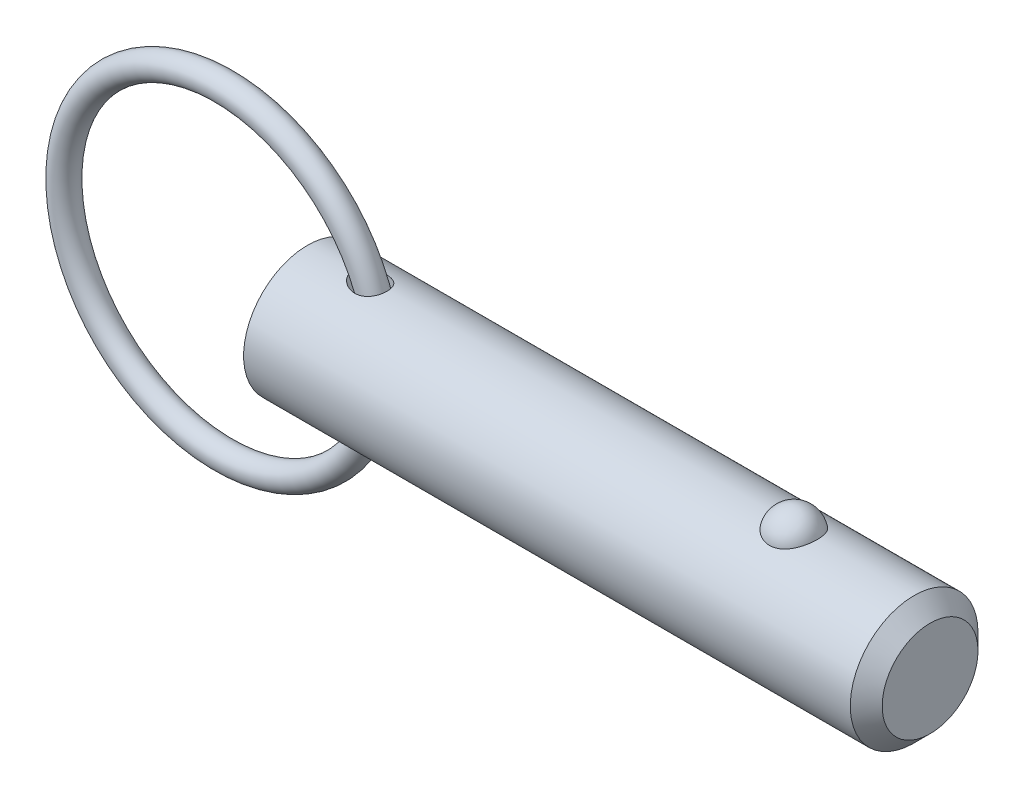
ISO-10303-21;
HEADER;
FILE_DESCRIPTION(('STEP AP214'),'2;1');
FILE_NAME('part.step','',(''),(''),'','','');
FILE_SCHEMA(('AUTOMOTIVE_DESIGN { 1 0 10303 214 1 1 1 1 }'));
ENDSEC;
DATA;
#1=APPLICATION_CONTEXT('core data for automotive mechanical design processes');
#2=APPLICATION_PROTOCOL_DEFINITION('international standard','automotive_design',2000,#1);
#3=PRODUCT_CONTEXT('',#1,'mechanical');
#4=PRODUCT('Part','Part','',(#3));
#5=PRODUCT_RELATED_PRODUCT_CATEGORY('part','',(#4));
#6=PRODUCT_DEFINITION_FORMATION('','',#4);
#7=PRODUCT_DEFINITION_CONTEXT('part definition',#1,'design');
#8=PRODUCT_DEFINITION('design','',#6,#7);
#9=PRODUCT_DEFINITION_SHAPE('','',#8);
#10=(LENGTH_UNIT() NAMED_UNIT(*) SI_UNIT(.MILLI.,.METRE.));
#11=(NAMED_UNIT(*) PLANE_ANGLE_UNIT() SI_UNIT($,.RADIAN.));
#12=(NAMED_UNIT(*) SI_UNIT($,.STERADIAN.) SOLID_ANGLE_UNIT());
#13=UNCERTAINTY_MEASURE_WITH_UNIT(LENGTH_MEASURE(1.E-05),#10,'distance_accuracy_value','');
#14=(GEOMETRIC_REPRESENTATION_CONTEXT(3) GLOBAL_UNCERTAINTY_ASSIGNED_CONTEXT((#13)) GLOBAL_UNIT_ASSIGNED_CONTEXT((#10,
#11,#12)) REPRESENTATION_CONTEXT('',''));
#15=CARTESIAN_POINT('',(0.,0.,0.));
#16=DIRECTION('',(0.,0.,1.));
#17=DIRECTION('',(1.,0.,0.));
#18=AXIS2_PLACEMENT_3D('',#15,#16,#17);
#19=CARTESIAN_POINT('',(-8.34703434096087,0.,0.));
#20=DIRECTION('',(0.,0.,1.));
#21=DIRECTION('',(1.,0.,0.));
#22=AXIS2_PLACEMENT_3D('',#19,#20,#21);
#23=TOROIDAL_SURFACE('',#22,15.875,1.27);
#24=CARTESIAN_POINT('',(8.79796565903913,0.,0.));
#25=VERTEX_POINT('',#24);
#26=VERTEX_LOOP('',#25);
#27=FACE_BOUND('',#26,.T.);
#28=ADVANCED_FACE('P0_F12',(#27),#23,.T.);
#29=CLOSED_SHELL('',(#28));
#30=MANIFOLD_SOLID_BREP('P0_B1',#29);
#31=CARTESIAN_POINT('',(0.,0.,0.));
#32=DIRECTION('',(1.,0.,0.));
#33=DIRECTION('',(0.,0.,-1.));
#34=AXIS2_PLACEMENT_3D('',#31,#32,#33);
#35=CYLINDRICAL_SURFACE('',#34,6.35);
#36=CARTESIAN_POINT('',(4.87230670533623,6.27273159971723,-0.987592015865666));
#37=CARTESIAN_POINT('',(4.94734735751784,6.26035058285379,-1.06623378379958));
#38=CARTESIAN_POINT('',(5.02968768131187,6.24755813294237,-1.13788608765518));
#39=CARTESIAN_POINT('',(5.20534267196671,6.22278258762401,-1.26640223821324));
#40=CARTESIAN_POINT('',(5.29867273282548,6.21080066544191,-1.32324497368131));
#41=CARTESIAN_POINT('',(5.49318962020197,6.18912414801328,-1.42117930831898));
#42=CARTESIAN_POINT('',(5.59435470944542,6.17942350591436,-1.46231273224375));
#43=CARTESIAN_POINT('',(5.802196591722,6.16352555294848,-1.52793951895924));
#44=CARTESIAN_POINT('',(5.90887152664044,6.15732706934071,-1.55243845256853));
#45=CARTESIAN_POINT('',(6.12818220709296,6.14931784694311,-1.58387975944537));
#46=CARTESIAN_POINT('',(6.24090110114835,6.14763959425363,-1.59029227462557));
#47=CARTESIAN_POINT('',(6.46560233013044,6.14965588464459,-1.58248630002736));
#48=CARTESIAN_POINT('',(6.57758514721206,6.15334646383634,-1.56828303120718));
#49=CARTESIAN_POINT('',(6.78516594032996,6.1652116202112,-1.52091398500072));
#50=CARTESIAN_POINT('',(6.88126802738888,6.17288876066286,-1.48983713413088));
#51=CARTESIAN_POINT('',(7.06576629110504,6.19149190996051,-1.41052329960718));
#52=CARTESIAN_POINT('',(7.15416739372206,6.20241582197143,-1.36229738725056));
#53=CARTESIAN_POINT('',(7.31166929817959,6.2248616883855,-1.25548983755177));
#54=CARTESIAN_POINT('',(7.38181442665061,6.23621734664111,-1.19840625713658));
#55=CARTESIAN_POINT('',(7.51101296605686,6.259037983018,-1.07284763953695));
#56=CARTESIAN_POINT('',(7.57006844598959,6.2705029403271,-1.00437473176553));
#57=CARTESIAN_POINT('',(7.67374693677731,6.29184873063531,-0.860384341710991));
#58=CARTESIAN_POINT('',(7.71876694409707,6.30176816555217,-0.785157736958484));
#59=CARTESIAN_POINT('',(7.79574491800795,6.31935829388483,-0.628053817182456));
#60=CARTESIAN_POINT('',(7.82770308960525,6.32702902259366,-0.546176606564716));
#61=CARTESIAN_POINT('',(7.87788845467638,6.33930929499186,-0.377876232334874));
#62=CARTESIAN_POINT('',(7.89608106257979,6.34391112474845,-0.291442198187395));
#63=CARTESIAN_POINT('',(7.91820729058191,6.34953044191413,-0.116652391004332));
#64=CARTESIAN_POINT('',(7.92214044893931,6.35054781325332,-0.0282965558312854));
#65=CARTESIAN_POINT('',(7.91564686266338,6.34888556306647,0.148263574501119));
#66=CARTESIAN_POINT('',(7.90515337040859,6.34618875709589,0.236465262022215));
#67=CARTESIAN_POINT('',(7.86991530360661,6.33735741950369,0.409798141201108));
#68=CARTESIAN_POINT('',(7.84517062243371,6.33122286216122,0.494929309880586));
#69=CARTESIAN_POINT('',(7.78199851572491,6.31618517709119,0.659657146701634));
#70=CARTESIAN_POINT('',(7.74357645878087,6.30728313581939,0.739255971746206));
#71=CARTESIAN_POINT('',(7.65396632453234,6.28769050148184,0.890663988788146));
#72=CARTESIAN_POINT('',(7.60277911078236,6.27700002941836,0.962473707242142));
#73=CARTESIAN_POINT('',(7.48925881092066,6.2550822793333,1.09590260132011));
#74=CARTESIAN_POINT('',(7.42698604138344,6.24385813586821,1.15757361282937));
#75=CARTESIAN_POINT('',(7.29283556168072,6.2220655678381,1.26951234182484));
#76=CARTESIAN_POINT('',(7.2209588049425,6.21149707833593,1.31978118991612));
#77=CARTESIAN_POINT('',(7.06971853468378,6.19216002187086,1.40772509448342));
#78=CARTESIAN_POINT('',(6.99035873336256,6.18339056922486,1.44540635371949));
#79=CARTESIAN_POINT('',(6.82642723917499,6.16851603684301,1.50762653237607));
#80=CARTESIAN_POINT('',(6.74185489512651,6.16241129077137,1.53216380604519));
#81=CARTESIAN_POINT('',(6.56686412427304,6.15321474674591,1.56869994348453));
#82=CARTESIAN_POINT('',(6.47634467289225,6.15023369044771,1.58023897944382));
#83=CARTESIAN_POINT('',(6.29456956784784,6.14778331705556,1.58974172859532));
#84=CARTESIAN_POINT('',(6.20331368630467,6.1483151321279,1.58770106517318));
#85=CARTESIAN_POINT('',(6.01385969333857,6.15284811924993,1.5700487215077));
#86=CARTESIAN_POINT('',(5.91578322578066,6.15715979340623,1.55322212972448));
#87=CARTESIAN_POINT('',(5.72331909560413,6.16902415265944,1.5054032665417));
#88=CARTESIAN_POINT('',(5.62893440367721,6.17657939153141,1.4743998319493));
#89=CARTESIAN_POINT('',(5.43572606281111,6.19502494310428,1.39499475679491));
#90=CARTESIAN_POINT('',(5.33755891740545,6.20619097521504,1.3450526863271));
#91=CARTESIAN_POINT('',(5.15090047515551,6.23006191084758,1.22975103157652));
#92=CARTESIAN_POINT('',(5.06240741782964,6.24276653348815,1.16439425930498));
#93=CARTESIAN_POINT('',(4.91171642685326,6.26607433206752,1.03083814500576));
#94=CARTESIAN_POINT('',(4.8475822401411,6.27668356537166,0.964825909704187));
#95=CARTESIAN_POINT('',(4.73090054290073,6.29683133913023,0.823112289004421));
#96=CARTESIAN_POINT('',(4.67833688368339,6.30637136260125,0.747424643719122));
#97=CARTESIAN_POINT('',(4.595431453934,6.32183254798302,0.601150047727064));
#98=CARTESIAN_POINT('',(4.56283099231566,6.32809321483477,0.531883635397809));
#99=CARTESIAN_POINT('',(4.50941370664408,6.33849198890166,0.388778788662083));
#100=CARTESIAN_POINT('',(4.48858876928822,6.34263155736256,0.314943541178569));
#101=CARTESIAN_POINT('',(4.46008864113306,6.3483236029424,0.164282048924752));
#102=CARTESIAN_POINT('',(4.45247558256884,6.34986385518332,0.0874434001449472));
#103=CARTESIAN_POINT('',(4.45121096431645,6.35011863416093,-0.0663538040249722));
#104=CARTESIAN_POINT('',(4.45755802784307,6.34883343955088,-0.143312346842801));
#105=CARTESIAN_POINT('',(4.48267656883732,6.34380948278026,-0.288945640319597));
#106=CARTESIAN_POINT('',(4.50045680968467,6.34026665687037,-0.357802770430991));
#107=CARTESIAN_POINT('',(4.54636050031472,6.33128211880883,-0.49181574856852));
#108=CARTESIAN_POINT('',(4.57448566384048,6.32584009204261,-0.556970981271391));
#109=CARTESIAN_POINT('',(4.64209700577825,6.31308107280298,-0.687092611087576));
#110=CARTESIAN_POINT('',(4.6822690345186,6.30565525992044,-0.75168940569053));
#111=CARTESIAN_POINT('',(4.77120834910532,6.28979741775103,-0.874524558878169));
#112=CARTESIAN_POINT('',(4.81998302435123,6.28136452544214,-0.932757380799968));
#113=CARTESIAN_POINT('',(4.87230670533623,6.27273159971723,-0.987592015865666));
#114=B_SPLINE_CURVE_WITH_KNOTS('',3,(#36,#37,#38,#39,#40,#41,#42,#43,#44,#45,#46,#47,#48,#49,
#50,#51,#52,#53,#54,#55,#56,#57,#58,#59,#60,#61,#62,#63,#64,#65,#66,#67,#68,#69,#70,#71,#72,#73,
#74,#75,#76,#77,#78,#79,#80,#81,#82,#83,#84,#85,#86,#87,#88,#89,#90,#91,#92,#93,#94,#95,#96,#97,
#98,#99,#100,#101,#102,#103,#104,#105,#106,#107,#108,#109,#110,#111,#112,#113),.UNSPECIFIED.,
.T.,.F.,(4,2,2,2,2,2,2,2,2,2,2,2,2,2,2,2,2,2,2,2,2,2,2,2,2,2,2,2,2,2,2,2,2,2,2,2,2,2,4),(0.,
0.327902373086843,0.65626964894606,0.98375647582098,1.31113357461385,1.64800657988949,
1.98463099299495,2.28681225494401,2.58879878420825,2.86088594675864,3.13292229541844,
3.39636481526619,3.65980320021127,3.92390128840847,4.18800792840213,4.45334062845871,
4.7186753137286,4.98390596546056,5.24911867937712,5.51293017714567,5.7767155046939,
6.04037065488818,6.30405880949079,6.57680801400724,6.84964512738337,7.14724526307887,
7.44508014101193,7.77572668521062,8.10631295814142,8.38318772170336,8.65967357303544,
8.8891530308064,9.11847418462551,9.34887088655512,9.57924486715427,9.79193291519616,
10.0046562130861,10.2330958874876,10.4617327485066),.UNSPECIFIED.);
#115=CARTESIAN_POINT('',(4.87230670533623,6.27273159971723,-0.987592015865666));
#116=VERTEX_POINT('',#115);
#117=EDGE_CURVE('P1_E40',#116,#116,#114,.T.);
#118=ORIENTED_EDGE('',*,*,#117,.T.);
#119=EDGE_LOOP('',(#118));
#120=FACE_BOUND('',#119,.T.);
#121=CARTESIAN_POINT('',(60.3125,0.,0.));
#122=DIRECTION('',(1.,0.,0.));
#123=DIRECTION('',(0.,0.,-1.));
#124=AXIS2_PLACEMENT_3D('',#121,#122,#123);
#125=CIRCLE('',#124,6.35);
#126=CARTESIAN_POINT('',(60.3125,0.,-6.35));
#127=VERTEX_POINT('',#126);
#128=EDGE_CURVE('P1_E25',#127,#127,#125,.T.);
#129=ORIENTED_EDGE('',*,*,#128,.F.);
#130=EDGE_LOOP('',(#129));
#131=FACE_BOUND('',#130,.T.);
#132=CARTESIAN_POINT('',(0.,0.,0.));
#133=DIRECTION('',(1.,0.,0.));
#134=DIRECTION('',(0.,0.,-1.));
#135=AXIS2_PLACEMENT_3D('',#132,#133,#134);
#136=CIRCLE('',#135,6.35);
#137=CARTESIAN_POINT('',(0.,0.,-6.35));
#138=VERTEX_POINT('',#137);
#139=EDGE_CURVE('P1_E9',#138,#138,#136,.T.);
#140=ORIENTED_EDGE('',*,*,#139,.T.);
#141=EDGE_LOOP('',(#140));
#142=FACE_BOUND('',#141,.T.);
#143=CARTESIAN_POINT('',(48.3500214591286,5.87502187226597,2.40969251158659));
#144=CARTESIAN_POINT('',(48.2250305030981,5.87501645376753,2.40969773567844));
#145=CARTESIAN_POINT('',(48.1000806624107,5.87916061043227,2.39967292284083));
#146=CARTESIAN_POINT('',(47.8539091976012,5.8952311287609,2.3599173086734));
#147=CARTESIAN_POINT('',(47.7326863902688,5.90715499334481,2.33019283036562));
#148=CARTESIAN_POINT('',(47.4975170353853,5.93739567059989,2.25201402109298));
#149=CARTESIAN_POINT('',(47.3835602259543,5.95570321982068,2.20358681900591));
#150=CARTESIAN_POINT('',(47.16557352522,5.99672067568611,2.08937987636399));
#151=CARTESIAN_POINT('',(47.0615457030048,6.01943149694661,2.02359652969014));
#152=CARTESIAN_POINT('',(46.8629437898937,6.06760647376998,1.87428969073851));
#153=CARTESIAN_POINT('',(46.7687268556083,6.09313095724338,1.79031110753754));
#154=CARTESIAN_POINT('',(46.5952557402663,6.14375873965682,1.60800178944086));
#155=CARTESIAN_POINT('',(46.5160043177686,6.16886196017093,1.50966841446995));
#156=CARTESIAN_POINT('',(46.3708457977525,6.21724600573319,1.29645884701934));
#157=CARTESIAN_POINT('',(46.3056885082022,6.24039621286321,1.18104158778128));
#158=CARTESIAN_POINT('',(46.1947035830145,6.28117277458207,0.940351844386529));
#159=CARTESIAN_POINT('',(46.1488776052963,6.29879865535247,0.815078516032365));
#160=CARTESIAN_POINT('',(46.0770234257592,6.32692073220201,0.556494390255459));
#161=CARTESIAN_POINT('',(46.051249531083,6.33732517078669,0.423102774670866));
#162=CARTESIAN_POINT('',(46.0209885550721,6.34957673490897,0.15354272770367));
#163=CARTESIAN_POINT('',(46.0165009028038,6.35142408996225,0.0173743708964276));
#164=CARTESIAN_POINT('',(46.0288655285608,6.34638925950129,-0.253036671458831));
#165=CARTESIAN_POINT('',(46.0455949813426,6.33955731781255,-0.387285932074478));
#166=CARTESIAN_POINT('',(46.099843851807,6.31794129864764,-0.650851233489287));
#167=CARTESIAN_POINT('',(46.1373636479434,6.30315707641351,-0.780167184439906));
#168=CARTESIAN_POINT('',(46.232500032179,6.26711642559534,-1.03041949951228));
#169=CARTESIAN_POINT('',(46.290143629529,6.24585130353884,-1.15134433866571));
#170=CARTESIAN_POINT('',(46.4243522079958,6.19905619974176,-1.38129800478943));
#171=CARTESIAN_POINT('',(46.5009187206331,6.17352587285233,-1.49032586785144));
#172=CARTESIAN_POINT('',(46.6717538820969,6.12080227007,-1.69393164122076));
#173=CARTESIAN_POINT('',(46.7661008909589,6.09360200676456,-1.78844209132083));
#174=CARTESIAN_POINT('',(46.9701196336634,6.04070434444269,-1.95970536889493));
#175=CARTESIAN_POINT('',(47.0797900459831,6.01500681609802,-2.03645972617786));
#176=CARTESIAN_POINT('',(47.3091876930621,5.96867714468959,-2.1684564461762));
#177=CARTESIAN_POINT('',(47.4286522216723,5.94794910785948,-2.2241206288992));
#178=CARTESIAN_POINT('',(47.6762188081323,5.91340580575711,-2.31440992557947));
#179=CARTESIAN_POINT('',(47.8043175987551,5.89958794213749,-2.3490429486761));
#180=CARTESIAN_POINT('',(48.058582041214,5.88111049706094,-2.39491590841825));
#181=CARTESIAN_POINT('',(48.1845207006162,5.87602512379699,-2.40724512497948));
#182=CARTESIAN_POINT('',(48.4367867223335,5.87428980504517,-2.41147867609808));
#183=CARTESIAN_POINT('',(48.563114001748,5.87763817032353,-2.40338710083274));
#184=CARTESIAN_POINT('',(48.8084170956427,5.89212921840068,-2.36762715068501));
#185=CARTESIAN_POINT('',(48.9274992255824,5.90302431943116,-2.34058030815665));
#186=CARTESIAN_POINT('',(49.1592447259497,5.93113752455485,-2.26839066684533));
#187=CARTESIAN_POINT('',(49.2719075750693,5.94835614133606,-2.22324640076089));
#188=CARTESIAN_POINT('',(49.4904009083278,5.98773016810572,-2.11493806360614));
#189=CARTESIAN_POINT('',(49.596028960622,6.00998499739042,-2.05140269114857));
#190=CARTESIAN_POINT('',(49.7953006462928,6.05690144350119,-1.90842705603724));
#191=CARTESIAN_POINT('',(49.8889415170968,6.08156361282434,-1.82898313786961));
#192=CARTESIAN_POINT('',(50.0666754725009,6.13211715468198,-1.65182429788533));
#193=CARTESIAN_POINT('',(50.150055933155,6.15800825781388,-1.55339381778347));
#194=CARTESIAN_POINT('',(50.2997900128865,6.20712834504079,-1.34374214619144));
#195=CARTESIAN_POINT('',(50.3661405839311,6.23035685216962,-1.23251867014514));
#196=CARTESIAN_POINT('',(50.4823455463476,6.27251177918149,-0.996447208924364));
#197=CARTESIAN_POINT('',(50.5316072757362,6.29127762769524,-0.871278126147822));
#198=CARTESIAN_POINT('',(50.6096142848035,6.3215862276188,-0.613870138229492));
#199=CARTESIAN_POINT('',(50.6383593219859,6.33312889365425,-0.481631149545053));
#200=CARTESIAN_POINT('',(50.6747705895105,6.34782349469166,-0.213672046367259));
#201=CARTESIAN_POINT('',(50.6824134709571,6.35096613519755,-0.0779482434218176));
#202=CARTESIAN_POINT('',(50.6763951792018,6.34851322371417,0.192943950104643));
#203=CARTESIAN_POINT('',(50.6627343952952,6.3429178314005,0.328112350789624));
#204=CARTESIAN_POINT('',(50.6145036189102,6.32360512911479,0.593406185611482));
#205=CARTESIAN_POINT('',(50.5800313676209,6.30992579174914,0.723552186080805));
#206=CARTESIAN_POINT('',(50.4909539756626,6.27586325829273,0.97583417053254));
#207=CARTESIAN_POINT('',(50.4363476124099,6.25547965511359,1.09796966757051));
#208=CARTESIAN_POINT('',(50.3077587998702,6.20998183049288,1.33148921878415));
#209=CARTESIAN_POINT('',(50.2336742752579,6.18484288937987,1.44281227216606));
#210=CARTESIAN_POINT('',(50.0678204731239,6.13258735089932,1.65087683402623));
#211=CARTESIAN_POINT('',(49.9760515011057,6.10547078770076,1.74761859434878));
#212=CARTESIAN_POINT('',(49.7771839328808,6.05235879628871,1.92350926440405));
#213=CARTESIAN_POINT('',(49.670133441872,6.0263601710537,2.00271146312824));
#214=CARTESIAN_POINT('',(49.4431384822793,5.97843747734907,2.14154159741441));
#215=CARTESIAN_POINT('',(49.323191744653,5.95651412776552,2.20116608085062));
#216=CARTESIAN_POINT('',(49.0645236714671,5.91812106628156,2.30250570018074));
#217=CARTESIAN_POINT('',(48.9250698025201,5.90217533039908,2.34256795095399));
#218=CARTESIAN_POINT('',(48.6403974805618,5.88063128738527,2.39615214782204));
#219=CARTESIAN_POINT('',(48.4951817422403,5.8750281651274,2.40968644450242));
#220=CARTESIAN_POINT('',(48.3500214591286,5.87502187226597,2.40969251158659));
#221=B_SPLINE_CURVE_WITH_KNOTS('',3,(#143,#144,#145,#146,#147,#148,#149,#150,#151,#152,#153,
#154,#155,#156,#157,#158,#159,#160,#161,#162,#163,#164,#165,#166,#167,#168,#169,#170,#171,#172,
#173,#174,#175,#176,#177,#178,#179,#180,#181,#182,#183,#184,#185,#186,#187,#188,#189,#190,#191,
#192,#193,#194,#195,#196,#197,#198,#199,#200,#201,#202,#203,#204,#205,#206,#207,#208,#209,#210,
#211,#212,#213,#214,#215,#216,#217,#218,#219,#220),.UNSPECIFIED.,.T.,.F.,(4,2,2,2,2,2,2,2,2,2,2,
2,2,2,2,2,2,2,2,2,2,2,2,2,2,2,2,2,2,2,2,2,2,2,2,2,2,2,4),(0.,0.374440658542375,0.74876119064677,
1.12254078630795,1.49639810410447,1.88098871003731,2.26565013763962,2.6674110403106,
3.06920639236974,3.47601794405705,3.88281858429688,4.28727498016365,4.69173873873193,
5.09674745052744,5.50178895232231,5.90865911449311,6.31549420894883,6.71369855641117,
7.11175305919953,7.48978077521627,7.86773278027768,8.2338388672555,8.59997464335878,
8.97409044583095,9.34829231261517,9.74122667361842,10.1342313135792,10.5397522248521,
10.9452779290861,11.3512521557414,11.7572189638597,12.1612938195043,12.5653932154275,
12.9716540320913,13.3779078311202,13.7829098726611,14.1879832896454,14.6230486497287,
15.0579114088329),.UNSPECIFIED.);
#222=CARTESIAN_POINT('',(48.3500214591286,5.87502187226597,2.40969251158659));
#223=VERTEX_POINT('',#222);
#224=EDGE_CURVE('P1_E34',#223,#223,#221,.T.);
#225=ORIENTED_EDGE('',*,*,#224,.T.);
#226=EDGE_LOOP('',(#225));
#227=FACE_BOUND('',#226,.T.);
#228=CARTESIAN_POINT('',(4.87230670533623,-6.27273159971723,-0.987592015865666));
#229=CARTESIAN_POINT('',(4.81440819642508,-6.28228431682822,-0.926913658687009));
#230=CARTESIAN_POINT('',(4.76085022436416,-6.29159289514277,-0.862071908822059));
#231=CARTESIAN_POINT('',(4.66448472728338,-6.3088950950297,-0.724655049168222));
#232=CARTESIAN_POINT('',(4.62166818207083,-6.31688981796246,-0.652086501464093));
#233=CARTESIAN_POINT('',(4.54882773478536,-6.33076917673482,-0.499747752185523));
#234=CARTESIAN_POINT('',(4.51891553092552,-6.33663532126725,-0.419921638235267));
#235=CARTESIAN_POINT('',(4.47476924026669,-6.3453711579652,-0.255882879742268));
#236=CARTESIAN_POINT('',(4.46051880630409,-6.34824397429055,-0.171674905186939));
#237=CARTESIAN_POINT('',(4.44966179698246,-6.35043041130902,-0.012076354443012));
#238=CARTESIAN_POINT('',(4.45117530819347,-6.35012328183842,0.063184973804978));
#239=CARTESIAN_POINT('',(4.46726452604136,-6.34689000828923,0.212230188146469));
#240=CARTESIAN_POINT('',(4.4818402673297,-6.3439638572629,0.286014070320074));
#241=CARTESIAN_POINT('',(4.52202068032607,-6.33603071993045,0.426550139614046));
#242=CARTESIAN_POINT('',(4.54707079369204,-6.33112875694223,0.493469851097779));
#243=CARTESIAN_POINT('',(4.60669855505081,-6.31972370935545,0.622743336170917));
#244=CARTESIAN_POINT('',(4.64127887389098,-6.31322017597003,0.685095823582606));
#245=CARTESIAN_POINT('',(4.72328142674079,-6.29826068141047,0.811769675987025));
#246=CARTESIAN_POINT('',(4.7717611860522,-6.28966287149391,0.87538636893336));
#247=CARTESIAN_POINT('',(4.87703902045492,-6.27182325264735,0.995192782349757));
#248=CARTESIAN_POINT('',(4.93384225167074,-6.26258104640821,1.05137785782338));
#249=CARTESIAN_POINT('',(5.06617436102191,-6.24228878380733,1.16635591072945));
#250=CARTESIAN_POINT('',(5.14318167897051,-6.23124423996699,1.22345054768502));
#251=CARTESIAN_POINT('',(5.30475767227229,-6.21023402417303,1.32598441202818));
#252=CARTESIAN_POINT('',(5.38933237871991,-6.20026922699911,1.37141422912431));
#253=CARTESIAN_POINT('',(5.5776013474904,-6.18099350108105,1.45601817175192));
#254=CARTESIAN_POINT('',(5.68224348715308,-6.17201456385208,1.4931788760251));
#255=CARTESIAN_POINT('',(5.89649087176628,-6.15800474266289,1.5499484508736));
#256=CARTESIAN_POINT('',(6.0060970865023,-6.15297463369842,1.56955387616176));
#257=CARTESIAN_POINT('',(6.22752772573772,-6.14779725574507,1.58971993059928));
#258=CARTESIAN_POINT('',(6.33935715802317,-6.14766266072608,1.59023112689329));
#259=CARTESIAN_POINT('',(6.56108231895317,-6.15269227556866,1.57066564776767));
#260=CARTESIAN_POINT('',(6.67097982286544,-6.15785133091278,1.55060899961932));
#261=CARTESIAN_POINT('',(6.87257705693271,-6.17211580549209,1.4927326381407));
#262=CARTESIAN_POINT('',(6.96494608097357,-6.18072242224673,1.45711948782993));
#263=CARTESIAN_POINT('',(7.14129343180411,-6.20069920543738,1.36960980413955));
#264=CARTESIAN_POINT('',(7.22527609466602,-6.21206793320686,1.31772174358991));
#265=CARTESIAN_POINT('',(7.37471505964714,-6.23497047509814,1.20443359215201));
#266=CARTESIAN_POINT('',(7.44115811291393,-6.24639757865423,1.14430788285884));
#267=CARTESIAN_POINT('',(7.56261868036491,-6.26896339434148,1.0134084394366));
#268=CARTESIAN_POINT('',(7.61763801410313,-6.28010215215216,0.942636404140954));
#269=CARTESIAN_POINT('',(7.71360563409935,-6.30055923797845,0.794304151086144));
#270=CARTESIAN_POINT('',(7.75485562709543,-6.3099143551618,0.716943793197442));
#271=CARTESIAN_POINT('',(7.82406051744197,-6.32610528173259,0.556244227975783));
#272=CARTESIAN_POINT('',(7.85201540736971,-6.33294108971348,0.472905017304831));
#273=CARTESIAN_POINT('',(7.89408663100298,-6.34338077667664,0.302249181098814));
#274=CARTESIAN_POINT('',(7.90814615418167,-6.34697138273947,0.214917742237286));
#275=CARTESIAN_POINT('',(7.92192329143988,-6.35048887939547,0.0390564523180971));
#276=CARTESIAN_POINT('',(7.92164046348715,-6.3504156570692,-0.0494734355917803));
#277=CARTESIAN_POINT('',(7.90670754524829,-6.34660520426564,-0.225592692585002));
#278=CARTESIAN_POINT('',(7.89199989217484,-6.34285329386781,-0.313176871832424));
#279=CARTESIAN_POINT('',(7.8484534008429,-6.33206809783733,-0.484549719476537));
#280=CARTESIAN_POINT('',(7.8196145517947,-6.32503480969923,-0.568338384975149));
#281=CARTESIAN_POINT('',(7.74850591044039,-6.30846389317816,-0.729625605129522));
#282=CARTESIAN_POINT('',(7.70625193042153,-6.29892921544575,-0.807131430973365));
#283=CARTESIAN_POINT('',(7.60933437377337,-6.27840608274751,-0.953731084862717));
#284=CARTESIAN_POINT('',(7.55467181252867,-6.2674177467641,-1.02282560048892));
#285=CARTESIAN_POINT('',(7.43471786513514,-6.24527869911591,-1.15028913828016));
#286=CARTESIAN_POINT('',(7.36948829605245,-6.23412925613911,-1.20871657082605));
#287=CARTESIAN_POINT('',(7.23001723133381,-6.21283678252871,-1.3137894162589));
#288=CARTESIAN_POINT('',(7.15577649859,-6.20269366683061,-1.36043582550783));
#289=CARTESIAN_POINT('',(7.00025986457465,-6.18446636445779,-1.44103993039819));
#290=CARTESIAN_POINT('',(6.91896776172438,-6.17638709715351,-1.47496739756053));
#291=CARTESIAN_POINT('',(6.75184232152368,-6.16309237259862,-1.52957024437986));
#292=CARTESIAN_POINT('',(6.66600814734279,-6.15787744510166,-1.55024317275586));
#293=CARTESIAN_POINT('',(6.48842585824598,-6.15055064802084,-1.57906962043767));
#294=CARTESIAN_POINT('',(6.39658108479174,-6.14857915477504,-1.58665744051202));
#295=CARTESIAN_POINT('',(6.21279832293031,-6.14817707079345,-1.58821048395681));
#296=CARTESIAN_POINT('',(6.12086031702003,-6.14974736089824,-1.58217231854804));
#297=CARTESIAN_POINT('',(5.92996902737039,-6.15640095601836,-1.55609403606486));
#298=CARTESIAN_POINT('',(5.83120653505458,-6.16181208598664,-1.53474519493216));
#299=CARTESIAN_POINT('',(5.63804881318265,-6.17573474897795,-1.47771859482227));
#300=CARTESIAN_POINT('',(5.5436595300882,-6.18425037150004,-1.44202192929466));
#301=CARTESIAN_POINT('',(5.3441392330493,-6.20522938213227,-1.34918979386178));
#302=CARTESIAN_POINT('',(5.24033140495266,-6.21813417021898,-1.28928337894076));
#303=CARTESIAN_POINT('',(5.04554233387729,-6.24510162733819,-1.15156760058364));
#304=CARTESIAN_POINT('',(4.9545459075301,-6.25916289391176,-1.07377972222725));
#305=CARTESIAN_POINT('',(4.87230670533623,-6.27273159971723,-0.987592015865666));
#306=B_SPLINE_CURVE_WITH_KNOTS('',3,(#228,#229,#230,#231,#232,#233,#234,#235,#236,#237,#238,
#239,#240,#241,#242,#243,#244,#245,#246,#247,#248,#249,#250,#251,#252,#253,#254,#255,#256,#257,
#258,#259,#260,#261,#262,#263,#264,#265,#266,#267,#268,#269,#270,#271,#272,#273,#274,#275,#276,
#277,#278,#279,#280,#281,#282,#283,#284,#285,#286,#287,#288,#289,#290,#291,#292,#293,#294,#295,
#296,#297,#298,#299,#300,#301,#302,#303,#304,#305),.UNSPECIFIED.,.T.,.F.,(4,2,2,2,2,2,2,2,2,2,2,
2,2,2,2,2,2,2,2,2,2,2,2,2,2,2,2,2,2,2,2,2,2,2,2,2,2,2,4),(0.,0.252951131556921,0.50568912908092,
0.760572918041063,1.01519041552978,1.23982791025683,1.46446600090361,1.67847364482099,
1.89254132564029,2.13299551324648,2.37359928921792,2.6619896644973,2.95061196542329,
3.28329078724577,3.61603488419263,3.94964035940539,4.282921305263,4.57939201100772,
4.87570862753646,5.14538810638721,5.4150245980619,5.67829123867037,5.94155802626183,
6.20589676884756,6.47024365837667,6.73564974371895,7.00105603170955,7.26615064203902,
7.53122356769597,7.79479837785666,8.05835088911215,8.32252586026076,8.58674967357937,
8.86213419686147,9.137587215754,9.43991696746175,9.74264642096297,10.1023688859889,
10.461661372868),.UNSPECIFIED.);
#307=CARTESIAN_POINT('',(4.87230670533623,-6.27273159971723,-0.987592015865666));
#308=VERTEX_POINT('',#307);
#309=EDGE_CURVE('P1_E17',#308,#308,#306,.T.);
#310=ORIENTED_EDGE('',*,*,#309,.T.);
#311=EDGE_LOOP('',(#310));
#312=FACE_BOUND('',#311,.T.);
#313=ADVANCED_FACE('P1_F13',(#120,#131,#142,#227,#312),#35,.T.);
#314=CARTESIAN_POINT('',(0.,0.,0.));
#315=DIRECTION('',(-1.,0.,0.));
#316=DIRECTION('',(0.,0.,1.));
#317=AXIS2_PLACEMENT_3D('',#314,#315,#316);
#318=PLANE('',#317);
#319=ORIENTED_EDGE('',*,*,#139,.F.);
#320=EDGE_LOOP('',(#319));
#321=FACE_BOUND('',#320,.T.);
#322=ADVANCED_FACE('P1_F15',(#321),#318,.T.);
#323=CARTESIAN_POINT('',(61.9,0.,0.));
#324=DIRECTION('',(-1.,0.,0.));
#325=DIRECTION('',(0.,0.,1.));
#326=AXIS2_PLACEMENT_3D('',#323,#324,#325);
#327=CONICAL_SURFACE('',#326,4.76250000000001,0.785398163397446);
#328=ORIENTED_EDGE('',*,*,#128,.T.);
#329=EDGE_LOOP('',(#328));
#330=FACE_BOUND('',#329,.T.);
#331=CARTESIAN_POINT('',(61.9,0.,0.));
#332=DIRECTION('',(1.,0.,0.));
#333=DIRECTION('',(0.,0.,-1.));
#334=AXIS2_PLACEMENT_3D('',#331,#332,#333);
#335=CIRCLE('',#334,4.76250000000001);
#336=CARTESIAN_POINT('',(61.9,0.,-4.76250000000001));
#337=VERTEX_POINT('',#336);
#338=EDGE_CURVE('P1_E30',#337,#337,#335,.T.);
#339=ORIENTED_EDGE('',*,*,#338,.F.);
#340=EDGE_LOOP('',(#339));
#341=FACE_BOUND('',#340,.T.);
#342=ADVANCED_FACE('P1_F55',(#330,#341),#327,.T.);
#343=CARTESIAN_POINT('',(61.9,4.76250000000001,0.));
#344=DIRECTION('',(1.,0.,0.));
#345=DIRECTION('',(0.,0.,-1.));
#346=AXIS2_PLACEMENT_3D('',#343,#344,#345);
#347=PLANE('',#346);
#348=ORIENTED_EDGE('',*,*,#338,.T.);
#349=EDGE_LOOP('',(#348));
#350=FACE_BOUND('',#349,.T.);
#351=ADVANCED_FACE('P1_F51',(#350),#347,.T.);
#352=CARTESIAN_POINT('',(48.3500214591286,5.715,0.));
#353=DIRECTION('',(-1.,0.,0.));
#354=DIRECTION('',(0.,1.,0.));
#355=AXIS2_PLACEMENT_3D('',#352,#353,#354);
#356=SPHERICAL_SURFACE('',#355,2.415);
#357=ORIENTED_EDGE('',*,*,#224,.F.);
#358=EDGE_LOOP('',(#357));
#359=FACE_BOUND('',#358,.T.);
#360=ADVANCED_FACE('P1_F46',(#359),#356,.T.);
#361=CARTESIAN_POINT('',(-8.34703434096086,0.,0.));
#362=DIRECTION('',(0.,0.,1.));
#363=DIRECTION('',(1.,0.,0.));
#364=AXIS2_PLACEMENT_3D('',#361,#362,#363);
#365=TOROIDAL_SURFACE('',#364,15.875,1.5875);
#366=ORIENTED_EDGE('',*,*,#309,.F.);
#367=EDGE_LOOP('',(#366));
#368=FACE_BOUND('',#367,.T.);
#369=ORIENTED_EDGE('',*,*,#117,.F.);
#370=EDGE_LOOP('',(#369));
#371=FACE_BOUND('',#370,.T.);
#372=ADVANCED_FACE('P1_F50',(#368,#371),#365,.F.);
#373=CLOSED_SHELL('',(#313,#322,#342,#351,#360,#372));
#374=MANIFOLD_SOLID_BREP('P1_B1',#373);
#375=ADVANCED_BREP_SHAPE_REPRESENTATION('',(#18,#30,#374),#14);
#376=SHAPE_DEFINITION_REPRESENTATION(#9,#375);
ENDSEC;
END-ISO-10303-21;
